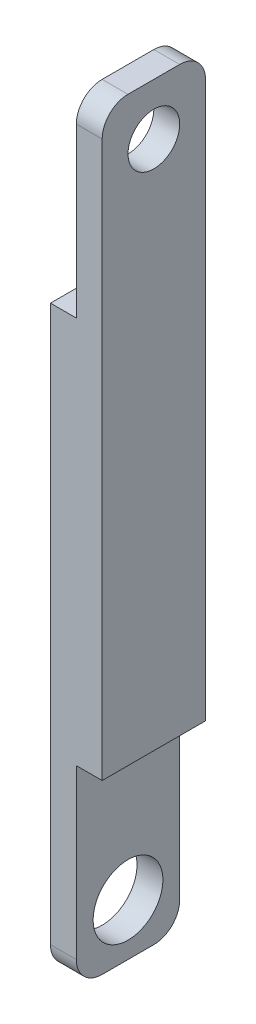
from build123d import *

# Parameters (mm, degrees)
SKETCH1_W           = 40
SKETCH1_H           = 300
BOSS_EXTRUDE1_DEPTH = 20
SKETCH2_W           = 40
SKETCH2_H           = 75
CUT_EXTRUDE1_DEPTH  = 10
SKETCH3_W           = 40
SKETCH3_H           = 75
CUT_EXTRUDE2_DEPTH  = 10
SKETCH4_R           = 13.5
CUT_EXTRUDE3_DEPTH  = 10
FILLET1_R           = 10
SKETCH5_R           = 10
CUT_EXTRUDE4_DEPTH  = 10


with BuildPart() as part:
    # Sketch1 → Boss-Extrude1 (new body)
    with BuildSketch(Plane(origin=(0, 0, 0), x_dir=(0, 0, -1), z_dir=(1, 0, 0))):
        Rectangle(SKETCH1_W, SKETCH1_H)
    extrude(amount=BOSS_EXTRUDE1_DEPTH)

    # Sketch2 → Cut-Extrude1 (cut)
    with BuildSketch(Plane.ZY):
        with Locations((0, 112.5)):
            Rectangle(SKETCH2_W, SKETCH2_H)
    extrude(amount=-CUT_EXTRUDE1_DEPTH, mode=Mode.SUBTRACT)

    # Sketch3 → Cut-Extrude2 (cut)
    with BuildSketch(Plane(origin=(20, 0, 0), x_dir=(0, 0, -1), z_dir=(1, 0, 0))):
        with Locations((0, -112.5)):
            Rectangle(SKETCH3_W, SKETCH3_H)
    extrude(amount=-CUT_EXTRUDE2_DEPTH, mode=Mode.SUBTRACT)

    # Sketch4 → Cut-Extrude3 (cut)
    with BuildSketch(Plane.ZY):
        with Locations((0, -130)):
            Circle(SKETCH4_R)
    extrude(amount=-CUT_EXTRUDE3_DEPTH, mode=Mode.SUBTRACT)

    # Fillet1
    fillet1_edges = [part.edges().sort_by_distance(p)[0] for p in [
        (5, -150, -20),
        (5, -150, 20),
        (15, 150, 20),
        (15, 150, -20),
    ]]
    fillet(fillet1_edges, radius=FILLET1_R)

    # Sketch5 → Cut-Extrude4 (cut)
    with BuildSketch(Plane(origin=(20, 0, 0), x_dir=(0, 0, -1), z_dir=(1, 0, 0))):
        with Locations((0, 130)):
            Circle(SKETCH5_R)
    extrude(amount=-CUT_EXTRUDE4_DEPTH, mode=Mode.SUBTRACT)


solid = part.part
